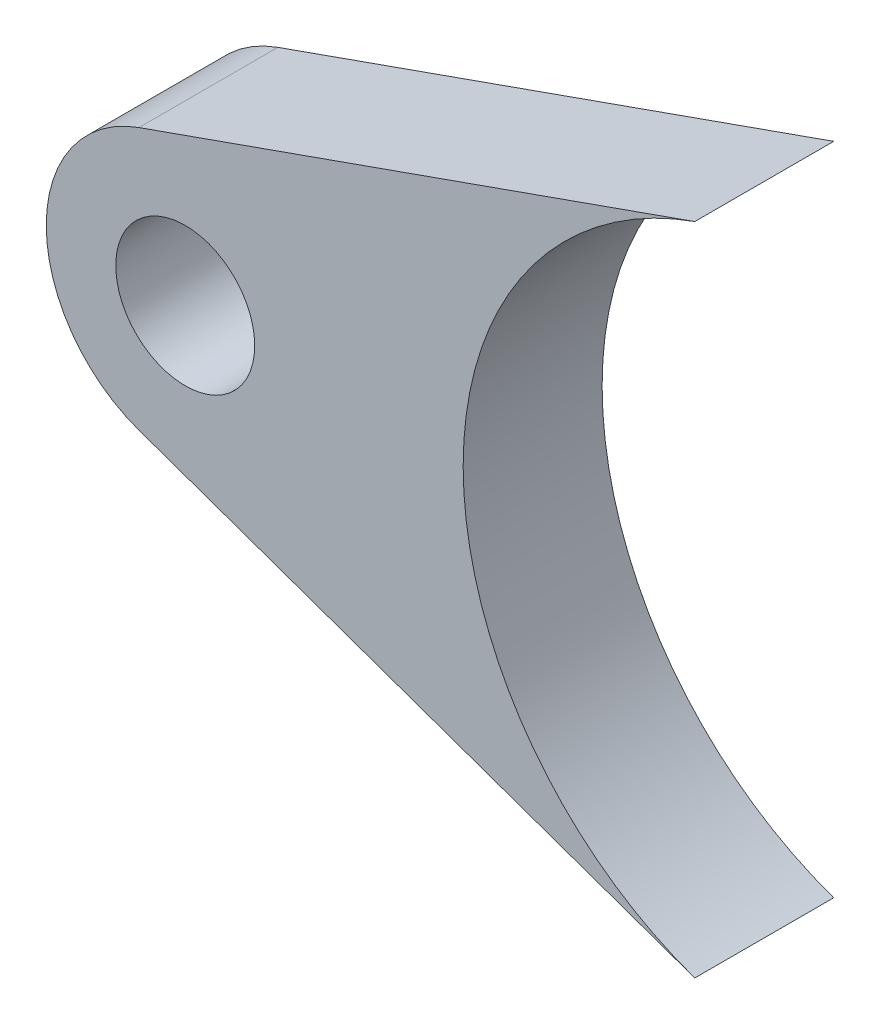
ISO-10303-21;
HEADER;
FILE_DESCRIPTION(('STEP AP214'),'2;1');
FILE_NAME('part.step','',(''),(''),'','','');
FILE_SCHEMA(('AUTOMOTIVE_DESIGN { 1 0 10303 214 1 1 1 1 }'));
ENDSEC;
DATA;
#1=APPLICATION_CONTEXT('core data for automotive mechanical design processes');
#2=APPLICATION_PROTOCOL_DEFINITION('international standard','automotive_design',2000,#1);
#3=PRODUCT_CONTEXT('',#1,'mechanical');
#4=PRODUCT('Part','Part','',(#3));
#5=PRODUCT_RELATED_PRODUCT_CATEGORY('part','',(#4));
#6=PRODUCT_DEFINITION_FORMATION('','',#4);
#7=PRODUCT_DEFINITION_CONTEXT('part definition',#1,'design');
#8=PRODUCT_DEFINITION('design','',#6,#7);
#9=PRODUCT_DEFINITION_SHAPE('','',#8);
#10=(LENGTH_UNIT() NAMED_UNIT(*) SI_UNIT(.MILLI.,.METRE.));
#11=(NAMED_UNIT(*) PLANE_ANGLE_UNIT() SI_UNIT($,.RADIAN.));
#12=(NAMED_UNIT(*) SI_UNIT($,.STERADIAN.) SOLID_ANGLE_UNIT());
#13=UNCERTAINTY_MEASURE_WITH_UNIT(LENGTH_MEASURE(1.E-05),#10,'distance_accuracy_value','');
#14=(GEOMETRIC_REPRESENTATION_CONTEXT(3) GLOBAL_UNCERTAINTY_ASSIGNED_CONTEXT((#13)) GLOBAL_UNIT_ASSIGNED_CONTEXT((#10,
#11,#12)) REPRESENTATION_CONTEXT('',''));
#15=CARTESIAN_POINT('',(0.,0.,0.));
#16=DIRECTION('',(0.,0.,1.));
#17=DIRECTION('',(1.,0.,0.));
#18=AXIS2_PLACEMENT_3D('',#15,#16,#17);
#19=CARTESIAN_POINT('',(0.,0.,20.));
#20=DIRECTION('',(0.,0.,1.));
#21=DIRECTION('',(1.,0.,0.));
#22=AXIS2_PLACEMENT_3D('',#19,#20,#21);
#23=PLANE('',#22);
#24=CARTESIAN_POINT('',(0.,0.,20.));
#25=DIRECTION('',(0.,0.,-1.));
#26=DIRECTION('',(1.,0.,0.));
#27=AXIS2_PLACEMENT_3D('',#24,#25,#26);
#28=CIRCLE('',#27,50.);
#29=CARTESIAN_POINT('',(-16.6666666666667,-47.1404520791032,20.));
#30=VERTEX_POINT('',#29);
#31=CARTESIAN_POINT('',(-16.6666666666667,47.1404520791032,20.));
#32=VERTEX_POINT('',#31);
#33=EDGE_CURVE('E83',#30,#32,#28,.T.);
#34=ORIENTED_EDGE('',*,*,#33,.T.);
#35=DIRECTION('',(-0.942809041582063,-0.333333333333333,0.));
#36=VECTOR('',#35,1.);
#37=CARTESIAN_POINT('',(-16.6666666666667,47.1404520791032,20.));
#38=LINE('',#37,#36);
#39=CARTESIAN_POINT('',(-96.6666666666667,18.8561808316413,20.));
#40=VERTEX_POINT('',#39);
#41=EDGE_CURVE('E78',#32,#40,#38,.T.);
#42=ORIENTED_EDGE('',*,*,#41,.T.);
#43=CARTESIAN_POINT('',(-90.,0.,20.));
#44=DIRECTION('',(0.,0.,1.));
#45=DIRECTION('',(1.,0.,0.));
#46=AXIS2_PLACEMENT_3D('',#43,#44,#45);
#47=CIRCLE('',#46,20.);
#48=CARTESIAN_POINT('',(-96.6666666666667,-18.8561808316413,20.));
#49=VERTEX_POINT('',#48);
#50=EDGE_CURVE('E81',#40,#49,#47,.T.);
#51=ORIENTED_EDGE('',*,*,#50,.T.);
#52=DIRECTION('',(0.942809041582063,-0.333333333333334,0.));
#53=VECTOR('',#52,1.);
#54=CARTESIAN_POINT('',(-96.6666666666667,-18.8561808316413,20.));
#55=LINE('',#54,#53);
#56=EDGE_CURVE('E48',#49,#30,#55,.T.);
#57=ORIENTED_EDGE('',*,*,#56,.T.);
#58=EDGE_LOOP('',(#34,#42,#51,#57));
#59=FACE_BOUND('',#58,.T.);
#60=CARTESIAN_POINT('',(-90.,0.,20.));
#61=DIRECTION('',(0.,0.,1.));
#62=DIRECTION('',(1.,0.,0.));
#63=AXIS2_PLACEMENT_3D('',#60,#61,#62);
#64=CIRCLE('',#63,9.99999999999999);
#65=CARTESIAN_POINT('',(-80.,0.,20.));
#66=VERTEX_POINT('',#65);
#67=EDGE_CURVE('E98',#66,#66,#64,.T.);
#68=ORIENTED_EDGE('',*,*,#67,.F.);
#69=EDGE_LOOP('',(#68));
#70=FACE_BOUND('',#69,.T.);
#71=ADVANCED_FACE('F31',(#59,#70),#23,.T.);
#72=CARTESIAN_POINT('',(0.,0.,0.));
#73=DIRECTION('',(0.,0.,1.));
#74=DIRECTION('',(1.,0.,0.));
#75=AXIS2_PLACEMENT_3D('',#72,#73,#74);
#76=PLANE('',#75);
#77=CARTESIAN_POINT('',(0.,0.,0.));
#78=DIRECTION('',(0.,0.,-1.));
#79=DIRECTION('',(1.,0.,0.));
#80=AXIS2_PLACEMENT_3D('',#77,#78,#79);
#81=CIRCLE('',#80,50.);
#82=CARTESIAN_POINT('',(-16.6666666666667,-47.1404520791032,0.));
#83=VERTEX_POINT('',#82);
#84=CARTESIAN_POINT('',(-16.6666666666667,47.1404520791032,0.));
#85=VERTEX_POINT('',#84);
#86=EDGE_CURVE('E95',#83,#85,#81,.T.);
#87=ORIENTED_EDGE('',*,*,#86,.F.);
#88=DIRECTION('',(0.942809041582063,-0.333333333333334,0.));
#89=VECTOR('',#88,1.);
#90=CARTESIAN_POINT('',(-96.6666666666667,-18.8561808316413,0.));
#91=LINE('',#90,#89);
#92=CARTESIAN_POINT('',(-96.6666666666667,-18.8561808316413,0.));
#93=VERTEX_POINT('',#92);
#94=EDGE_CURVE('E71',#93,#83,#91,.T.);
#95=ORIENTED_EDGE('',*,*,#94,.F.);
#96=CARTESIAN_POINT('',(-90.,0.,0.));
#97=DIRECTION('',(0.,0.,1.));
#98=DIRECTION('',(1.,0.,0.));
#99=AXIS2_PLACEMENT_3D('',#96,#97,#98);
#100=CIRCLE('',#99,20.);
#101=CARTESIAN_POINT('',(-96.6666666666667,18.8561808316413,0.));
#102=VERTEX_POINT('',#101);
#103=EDGE_CURVE('E65',#102,#93,#100,.T.);
#104=ORIENTED_EDGE('',*,*,#103,.F.);
#105=DIRECTION('',(-0.942809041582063,-0.333333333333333,0.));
#106=VECTOR('',#105,1.);
#107=CARTESIAN_POINT('',(-16.6666666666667,47.1404520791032,0.));
#108=LINE('',#107,#106);
#109=EDGE_CURVE('E87',#85,#102,#108,.T.);
#110=ORIENTED_EDGE('',*,*,#109,.F.);
#111=EDGE_LOOP('',(#87,#95,#104,#110));
#112=FACE_BOUND('',#111,.T.);
#113=CARTESIAN_POINT('',(-90.,0.,0.));
#114=DIRECTION('',(0.,0.,1.));
#115=DIRECTION('',(1.,0.,0.));
#116=AXIS2_PLACEMENT_3D('',#113,#114,#115);
#117=CIRCLE('',#116,9.99999999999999);
#118=CARTESIAN_POINT('',(-80.,0.,0.));
#119=VERTEX_POINT('',#118);
#120=EDGE_CURVE('E110',#119,#119,#117,.T.);
#121=ORIENTED_EDGE('',*,*,#120,.T.);
#122=EDGE_LOOP('',(#121));
#123=FACE_BOUND('',#122,.T.);
#124=ADVANCED_FACE('F106',(#112,#123),#76,.F.);
#125=CARTESIAN_POINT('',(0.,0.,20.));
#126=DIRECTION('',(0.,0.,-1.));
#127=DIRECTION('',(-1.,0.,0.));
#128=AXIS2_PLACEMENT_3D('',#125,#126,#127);
#129=CYLINDRICAL_SURFACE('',#128,50.);
#130=ORIENTED_EDGE('',*,*,#86,.T.);
#131=DIRECTION('',(0.,0.,-1.));
#132=VECTOR('',#131,1.);
#133=CARTESIAN_POINT('',(-16.6666666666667,47.1404520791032,20.));
#134=LINE('',#133,#132);
#135=EDGE_CURVE('E11',#32,#85,#134,.T.);
#136=ORIENTED_EDGE('',*,*,#135,.F.);
#137=ORIENTED_EDGE('',*,*,#33,.F.);
#138=DIRECTION('',(0.,0.,-1.));
#139=VECTOR('',#138,1.);
#140=CARTESIAN_POINT('',(-16.6666666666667,-47.1404520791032,20.));
#141=LINE('',#140,#139);
#142=EDGE_CURVE('E91',#30,#83,#141,.T.);
#143=ORIENTED_EDGE('',*,*,#142,.T.);
#144=EDGE_LOOP('',(#130,#136,#137,#143));
#145=FACE_BOUND('',#144,.T.);
#146=ADVANCED_FACE('F33',(#145),#129,.F.);
#147=CARTESIAN_POINT('',(-16.6666666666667,47.1404520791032,20.));
#148=DIRECTION('',(0.333333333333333,-0.942809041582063,0.));
#149=DIRECTION('',(0.942809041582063,0.333333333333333,0.));
#150=AXIS2_PLACEMENT_3D('',#147,#148,#149);
#151=PLANE('',#150);
#152=ORIENTED_EDGE('',*,*,#109,.T.);
#153=DIRECTION('',(0.,0.,-1.));
#154=VECTOR('',#153,1.);
#155=CARTESIAN_POINT('',(-96.6666666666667,18.8561808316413,20.));
#156=LINE('',#155,#154);
#157=EDGE_CURVE('E40',#40,#102,#156,.T.);
#158=ORIENTED_EDGE('',*,*,#157,.F.);
#159=ORIENTED_EDGE('',*,*,#41,.F.);
#160=ORIENTED_EDGE('',*,*,#135,.T.);
#161=EDGE_LOOP('',(#152,#158,#159,#160));
#162=FACE_BOUND('',#161,.T.);
#163=ADVANCED_FACE('F86',(#162),#151,.F.);
#164=CARTESIAN_POINT('',(-90.,0.,20.));
#165=DIRECTION('',(0.,0.,-1.));
#166=DIRECTION('',(-1.,0.,0.));
#167=AXIS2_PLACEMENT_3D('',#164,#165,#166);
#168=CYLINDRICAL_SURFACE('',#167,20.);
#169=ORIENTED_EDGE('',*,*,#103,.T.);
#170=DIRECTION('',(0.,0.,-1.));
#171=VECTOR('',#170,1.);
#172=CARTESIAN_POINT('',(-96.6666666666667,-18.8561808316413,20.));
#173=LINE('',#172,#171);
#174=EDGE_CURVE('E88',#49,#93,#173,.T.);
#175=ORIENTED_EDGE('',*,*,#174,.F.);
#176=ORIENTED_EDGE('',*,*,#50,.F.);
#177=ORIENTED_EDGE('',*,*,#157,.T.);
#178=EDGE_LOOP('',(#169,#175,#176,#177));
#179=FACE_BOUND('',#178,.T.);
#180=ADVANCED_FACE('F89',(#179),#168,.T.);
#181=CARTESIAN_POINT('',(-96.6666666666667,-18.8561808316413,20.));
#182=DIRECTION('',(0.333333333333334,0.942809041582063,0.));
#183=DIRECTION('',(-0.942809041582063,0.333333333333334,0.));
#184=AXIS2_PLACEMENT_3D('',#181,#182,#183);
#185=PLANE('',#184);
#186=ORIENTED_EDGE('',*,*,#94,.T.);
#187=ORIENTED_EDGE('',*,*,#142,.F.);
#188=ORIENTED_EDGE('',*,*,#56,.F.);
#189=ORIENTED_EDGE('',*,*,#174,.T.);
#190=EDGE_LOOP('',(#186,#187,#188,#189));
#191=FACE_BOUND('',#190,.T.);
#192=ADVANCED_FACE('F103',(#191),#185,.F.);
#193=CARTESIAN_POINT('',(-90.,0.,20.));
#194=DIRECTION('',(0.,0.,-1.));
#195=DIRECTION('',(-1.,0.,0.));
#196=AXIS2_PLACEMENT_3D('',#193,#194,#195);
#197=CYLINDRICAL_SURFACE('',#196,9.99999999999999);
#198=ORIENTED_EDGE('',*,*,#67,.T.);
#199=EDGE_LOOP('',(#198));
#200=FACE_BOUND('',#199,.T.);
#201=ORIENTED_EDGE('',*,*,#120,.F.);
#202=EDGE_LOOP('',(#201));
#203=FACE_BOUND('',#202,.T.);
#204=ADVANCED_FACE('F116',(#200,#203),#197,.F.);
#205=CLOSED_SHELL('',(#71,#124,#146,#163,#180,#192,#204));
#206=MANIFOLD_SOLID_BREP('B2',#205);
#207=ADVANCED_BREP_SHAPE_REPRESENTATION('',(#18,#206),#14);
#208=SHAPE_DEFINITION_REPRESENTATION(#9,#207);
ENDSEC;
END-ISO-10303-21;
